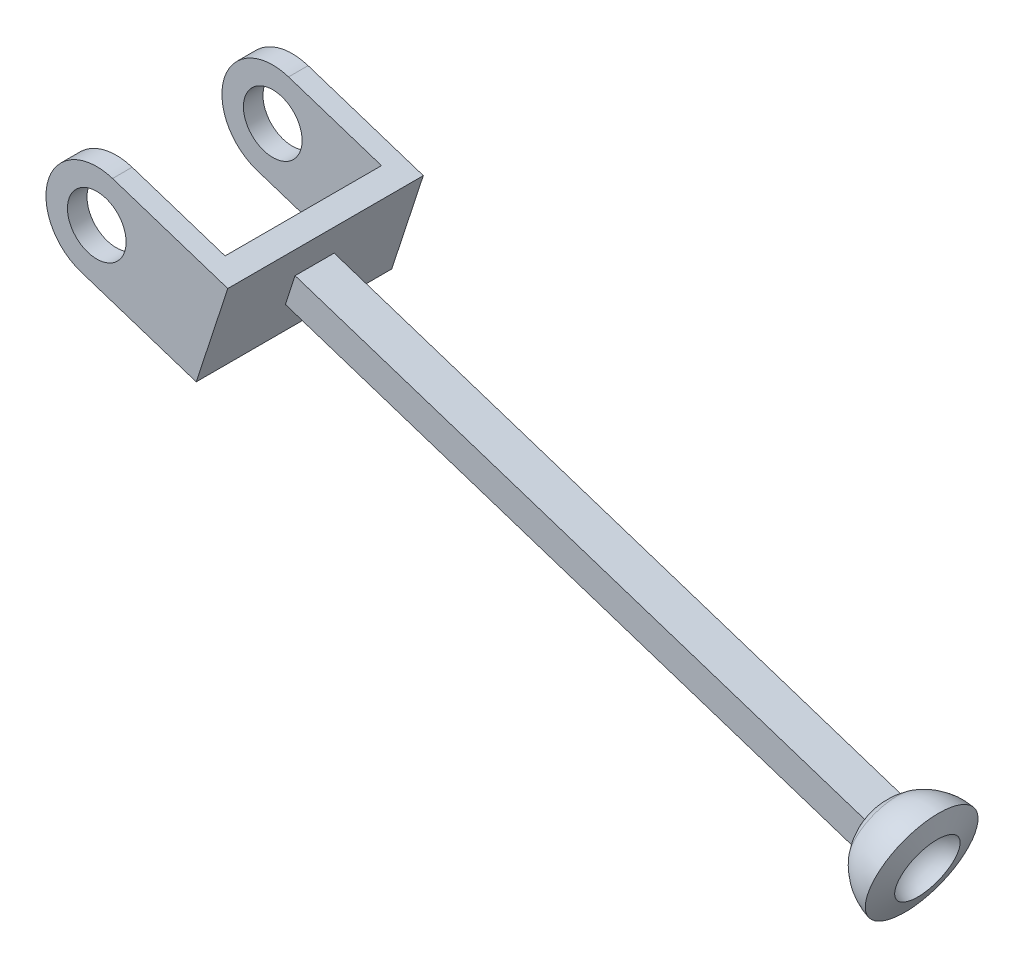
ISO-10303-21;
HEADER;
FILE_DESCRIPTION(('STEP AP214'),'2;1');
FILE_NAME('part.step','',(''),(''),'','','');
FILE_SCHEMA(('AUTOMOTIVE_DESIGN { 1 0 10303 214 1 1 1 1 }'));
ENDSEC;
DATA;
#1=APPLICATION_CONTEXT('core data for automotive mechanical design processes');
#2=APPLICATION_PROTOCOL_DEFINITION('international standard','automotive_design',2000,#1);
#3=PRODUCT_CONTEXT('',#1,'mechanical');
#4=PRODUCT('Part','Part','',(#3));
#5=PRODUCT_RELATED_PRODUCT_CATEGORY('part','',(#4));
#6=PRODUCT_DEFINITION_FORMATION('','',#4);
#7=PRODUCT_DEFINITION_CONTEXT('part definition',#1,'design');
#8=PRODUCT_DEFINITION('design','',#6,#7);
#9=PRODUCT_DEFINITION_SHAPE('','',#8);
#10=(LENGTH_UNIT() NAMED_UNIT(*) SI_UNIT(.MILLI.,.METRE.));
#11=(NAMED_UNIT(*) PLANE_ANGLE_UNIT() SI_UNIT($,.RADIAN.));
#12=(NAMED_UNIT(*) SI_UNIT($,.STERADIAN.) SOLID_ANGLE_UNIT());
#13=UNCERTAINTY_MEASURE_WITH_UNIT(LENGTH_MEASURE(1.E-05),#10,'distance_accuracy_value','');
#14=(GEOMETRIC_REPRESENTATION_CONTEXT(3) GLOBAL_UNCERTAINTY_ASSIGNED_CONTEXT((#13)) GLOBAL_UNIT_ASSIGNED_CONTEXT((#10,
#11,#12)) REPRESENTATION_CONTEXT('',''));
#15=CARTESIAN_POINT('',(0.,0.,0.));
#16=DIRECTION('',(0.,0.,1.));
#17=DIRECTION('',(1.,0.,0.));
#18=AXIS2_PLACEMENT_3D('',#15,#16,#17);
#19=CARTESIAN_POINT('',(13195.3800261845,5759.56814998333,-22.8728127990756));
#20=DIRECTION('',(0.950575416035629,-0.310493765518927,1.60278153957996E-06));
#21=DIRECTION('',(0.310493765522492,0.950575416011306,-6.8262459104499E-06));
#22=AXIS2_PLACEMENT_3D('',#19,#20,#21);
#23=SPHERICAL_SURFACE('',#22,9.14400000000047);
#24=CARTESIAN_POINT('',(13188.6677202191,5761.76064215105,-22.87282411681));
#25=DIRECTION('',(0.950575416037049,-0.31049376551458,1.60278153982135E-06));
#26=DIRECTION('',(0.310493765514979,0.95057541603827,0.));
#27=AXIS2_PLACEMENT_3D('',#24,#25,#26);
#28=CIRCLE('',#27,5.80953205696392);
#29=CARTESIAN_POINT('',(13190.4715437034,5767.28304050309,-22.87282411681));
#30=VERTEX_POINT('',#29);
#31=EDGE_CURVE('E170',#30,#30,#28,.T.);
#32=ORIENTED_EDGE('',*,*,#31,.F.);
#33=EDGE_LOOP('',(#32));
#34=FACE_BOUND('',#33,.T.);
#35=CARTESIAN_POINT('',(13195.3800280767,5759.56817216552,-19.6978127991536));
#36=DIRECTION('',(-5.95942068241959E-07,-6.98651522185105E-06,-0.999999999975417));
#37=DIRECTION('',(0.,0.999999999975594,-6.9865152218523E-06));
#38=AXIS2_PLACEMENT_3D('',#35,#36,#37);
#39=CIRCLE('',#38,8.57508664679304);
#40=CARTESIAN_POINT('',(13186.8059052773,5759.69673818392,-19.6978085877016));
#41=VERTEX_POINT('',#40);
#42=CARTESIAN_POINT('',(13188.3832136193,5764.52566129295,-19.6978432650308));
#43=VERTEX_POINT('',#42);
#44=EDGE_CURVE('E42',#41,#43,#39,.T.);
#45=ORIENTED_EDGE('',*,*,#44,.F.);
#46=CARTESIAN_POINT('',(13194.5913720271,5757.15368844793,-22.8727954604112));
#47=DIRECTION('',(-0.310493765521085,-0.950575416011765,6.82624591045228E-06));
#48=DIRECTION('',(0.950575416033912,-0.310493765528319,0.));
#49=AXIS2_PLACEMENT_3D('',#46,#47,#48);
#50=CIRCLE('',#49,8.78414117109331);
#51=CARTESIAN_POINT('',(13186.805901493,5759.69669381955,-26.0478085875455));
#52=VERTEX_POINT('',#51);
#53=EDGE_CURVE('E182',#41,#52,#50,.T.);
#54=ORIENTED_EDGE('',*,*,#53,.T.);
#55=CARTESIAN_POINT('',(13195.3800242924,5759.56812780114,-26.0478127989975));
#56=DIRECTION('',(5.9594206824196E-07,6.98651522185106E-06,0.999999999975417));
#57=DIRECTION('',(0.,-0.999999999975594,6.9865152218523E-06));
#58=AXIS2_PLACEMENT_3D('',#55,#56,#57);
#59=CIRCLE('',#58,8.57508664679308);
#60=CARTESIAN_POINT('',(13188.3832098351,5764.52561692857,-26.0478432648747));
#61=VERTEX_POINT('',#60);
#62=EDGE_CURVE('E179',#61,#52,#59,.T.);
#63=ORIENTED_EDGE('',*,*,#62,.F.);
#64=CARTESIAN_POINT('',(13196.1686803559,5761.98261156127,-22.8728301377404));
#65=DIRECTION('',(0.310493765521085,0.950575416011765,-6.82624591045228E-06));
#66=DIRECTION('',(-0.950575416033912,0.310493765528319,0.));
#67=AXIS2_PLACEMENT_3D('',#64,#65,#66);
#68=CIRCLE('',#67,8.78414115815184);
#69=EDGE_CURVE('E176',#61,#43,#68,.T.);
#70=ORIENTED_EDGE('',*,*,#69,.T.);
#71=EDGE_LOOP('',(#45,#54,#63,#70));
#72=FACE_BOUND('',#71,.T.);
#73=ADVANCED_FACE('F32',(#34,#72),#23,.T.);
#74=CARTESIAN_POINT('',(13085.847290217,5792.67360498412,-22.8729788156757));
#75=DIRECTION('',(-0.310493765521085,-0.950575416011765,6.82624591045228E-06));
#76=DIRECTION('',(0.950575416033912,-0.310493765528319,0.));
#77=AXIS2_PLACEMENT_3D('',#74,#75,#76);
#78=PLANE('',#77);
#79=DIRECTION('',(5.95942089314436E-07,6.98651521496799E-06,0.999999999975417));
#80=VECTOR('',#79,1.);
#81=CARTESIAN_POINT('',(13094.2979056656,5789.91331540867,-22.872964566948));
#82=LINE('',#81,#80);
#83=CARTESIAN_POINT('',(13094.2979037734,5789.91329322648,-26.0479645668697));
#84=VERTEX_POINT('',#83);
#85=CARTESIAN_POINT('',(13094.2979075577,5789.91333759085,-19.6979645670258));
#86=VERTEX_POINT('',#85);
#87=EDGE_CURVE('E57',#84,#86,#82,.T.);
#88=ORIENTED_EDGE('',*,*,#87,.F.);
#89=DIRECTION('',(0.950575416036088,-0.310493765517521,1.6027815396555E-06));
#90=VECTOR('',#89,1.);
#91=CARTESIAN_POINT('',(13091.8834422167,5790.7019473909,-26.0479686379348));
#92=LINE('',#91,#90);
#93=EDGE_CURVE('E36',#84,#52,#92,.T.);
#94=ORIENTED_EDGE('',*,*,#93,.T.);
#95=ORIENTED_EDGE('',*,*,#53,.F.);
#96=DIRECTION('',(-0.950575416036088,0.310493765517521,-1.60278153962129E-06));
#97=VECTOR('',#96,1.);
#98=CARTESIAN_POINT('',(13188.2865577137,5759.21310128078,-19.6978060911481));
#99=LINE('',#98,#97);
#100=EDGE_CURVE('E214',#41,#86,#99,.T.);
#101=ORIENTED_EDGE('',*,*,#100,.T.);
#102=EDGE_LOOP('',(#88,#94,#95,#101));
#103=FACE_BOUND('',#102,.T.);
#104=ADVANCED_FACE('F263',(#103),#78,.T.);
#105=CARTESIAN_POINT('',(13087.4245966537,5797.50250591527,-26.0480134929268));
#106=DIRECTION('',(5.9594206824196E-07,6.98651522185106E-06,0.999999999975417));
#107=DIRECTION('',(0.,-0.999999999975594,6.9865152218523E-06));
#108=AXIS2_PLACEMENT_3D('',#105,#106,#107);
#109=PLANE('',#108);
#110=ORIENTED_EDGE('',*,*,#93,.F.);
#111=DIRECTION('',(0.310493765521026,0.950575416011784,-6.82624591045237E-06));
#112=VECTOR('',#111,1.);
#113=CARTESIAN_POINT('',(13095.8752121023,5794.74221633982,-26.047999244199));
#114=LINE('',#113,#112);
#115=CARTESIAN_POINT('',(13095.8752121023,5794.74221633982,-26.047999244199));
#116=VERTEX_POINT('',#115);
#117=EDGE_CURVE('E165',#84,#116,#114,.T.);
#118=ORIENTED_EDGE('',*,*,#117,.T.);
#119=DIRECTION('',(-0.950575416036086,0.310493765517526,-1.60278153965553E-06));
#120=VECTOR('',#119,1.);
#121=CARTESIAN_POINT('',(13189.8638622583,5764.04198002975,-26.0478407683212));
#122=LINE('',#121,#120);
#123=EDGE_CURVE('E206',#61,#116,#122,.T.);
#124=ORIENTED_EDGE('',*,*,#123,.F.);
#125=ORIENTED_EDGE('',*,*,#62,.T.);
#126=EDGE_LOOP('',(#110,#118,#124,#125));
#127=FACE_BOUND('',#126,.T.);
#128=ADVANCED_FACE('F266',(#127),#109,.F.);
#129=CARTESIAN_POINT('',(13190.5431421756,5763.82012440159,-22.8728396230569));
#130=DIRECTION('',(0.310493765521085,0.950575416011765,-6.82624591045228E-06));
#131=DIRECTION('',(-0.950575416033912,0.310493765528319,0.));
#132=AXIS2_PLACEMENT_3D('',#129,#130,#131);
#133=PLANE('',#132);
#134=DIRECTION('',(-5.95942089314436E-07,-6.98651521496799E-06,-0.999999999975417));
#135=VECTOR('',#134,1.);
#136=CARTESIAN_POINT('',(13095.8752139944,5794.74223852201,-22.8729992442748));
#137=LINE('',#136,#135);
#138=CARTESIAN_POINT('',(13095.8752158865,5794.74226070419,-19.6979992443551));
#139=VERTEX_POINT('',#138);
#140=EDGE_CURVE('E163',#139,#116,#137,.T.);
#141=ORIENTED_EDGE('',*,*,#140,.F.);
#142=DIRECTION('',(0.95057541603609,-0.310493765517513,1.60278153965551E-06));
#143=VECTOR('',#142,1.);
#144=CARTESIAN_POINT('',(13093.4607543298,5795.53091486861,-19.6980033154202));
#145=LINE('',#144,#143);
#146=EDGE_CURVE('E210',#139,#43,#145,.T.);
#147=ORIENTED_EDGE('',*,*,#146,.T.);
#148=ORIENTED_EDGE('',*,*,#69,.F.);
#149=ORIENTED_EDGE('',*,*,#123,.T.);
#150=EDGE_LOOP('',(#141,#147,#148,#149));
#151=FACE_BOUND('',#150,.T.);
#152=ADVANCED_FACE('F270',(#151),#133,.T.);
#153=CARTESIAN_POINT('',(13190.5431440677,5763.82014658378,-19.697839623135));
#154=DIRECTION('',(-5.95942068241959E-07,-6.98651522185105E-06,-0.999999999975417));
#155=DIRECTION('',(0.,0.999999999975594,-6.9865152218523E-06));
#156=AXIS2_PLACEMENT_3D('',#153,#154,#155);
#157=PLANE('',#156);
#158=ORIENTED_EDGE('',*,*,#146,.F.);
#159=DIRECTION('',(-0.310493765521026,-0.950575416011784,6.82624591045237E-06));
#160=VECTOR('',#159,1.);
#161=CARTESIAN_POINT('',(13095.8752158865,5794.74226070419,-19.6979992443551));
#162=LINE('',#161,#160);
#163=EDGE_CURVE('E11',#139,#86,#162,.T.);
#164=ORIENTED_EDGE('',*,*,#163,.T.);
#165=ORIENTED_EDGE('',*,*,#100,.F.);
#166=ORIENTED_EDGE('',*,*,#44,.T.);
#167=EDGE_LOOP('',(#158,#164,#165,#166));
#168=FACE_BOUND('',#167,.T.);
#169=ADVANCED_FACE('F34',(#168),#157,.F.);
#170=CARTESIAN_POINT('',(13194.9564544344,5759.70650448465,-22.8728135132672));
#171=DIRECTION('',(0.950575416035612,-0.310493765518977,1.60278153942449E-06));
#172=DIRECTION('',(0.310493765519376,0.950575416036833,0.));
#173=AXIS2_PLACEMENT_3D('',#170,#171,#172);
#174=DEGENERATE_TOROIDAL_SURFACE('',#173,0.128854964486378,8.88999999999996,.F.);
#175=ORIENTED_EDGE('',*,*,#31,.T.);
#176=EDGE_LOOP('',(#175));
#177=FACE_BOUND('',#176,.T.);
#178=CARTESIAN_POINT('',(13194.4465426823,5759.87306088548,-22.8728143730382));
#179=DIRECTION('',(0.950575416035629,-0.310493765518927,1.60278153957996E-06));
#180=DIRECTION('',(0.310493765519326,0.95057541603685,0.));
#181=AXIS2_PLACEMENT_3D('',#178,#179,#180);
#182=CIRCLE('',#181,8.74494630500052);
#183=CARTESIAN_POINT('',(13197.1617939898,5768.18579185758,-22.8728143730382));
#184=VERTEX_POINT('',#183);
#185=EDGE_CURVE('E169',#184,#184,#182,.F.);
#186=ORIENTED_EDGE('',*,*,#185,.T.);
#187=EDGE_LOOP('',(#186));
#188=FACE_BOUND('',#187,.T.);
#189=ADVANCED_FACE('F315',(#177,#188),#174,.F.);
#190=CARTESIAN_POINT('',(13195.3800261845,5759.56814998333,-22.8728127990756));
#191=DIRECTION('',(0.950575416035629,-0.310493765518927,1.60278153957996E-06));
#192=DIRECTION('',(0.310493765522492,0.950575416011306,-6.8262459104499E-06));
#193=AXIS2_PLACEMENT_3D('',#190,#191,#192);
#194=SPHERICAL_SURFACE('',#193,5.07999999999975);
#195=CARTESIAN_POINT('',(13195.3800261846,5759.56814998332,-22.8728127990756));
#196=DIRECTION('',(0.950575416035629,-0.310493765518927,1.60278153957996E-06));
#197=DIRECTION('',(0.310493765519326,0.95057541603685,0.));
#198=AXIS2_PLACEMENT_3D('',#195,#196,#197);
#199=CIRCLE('',#198,5.08000000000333);
#200=CARTESIAN_POINT('',(13196.9573345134,5764.39707309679,-22.8728127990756));
#201=VERTEX_POINT('',#200);
#202=EDGE_CURVE('E173',#201,#201,#199,.T.);
#203=ORIENTED_EDGE('',*,*,#202,.T.);
#204=EDGE_LOOP('',(#203));
#205=FACE_BOUND('',#204,.T.);
#206=ADVANCED_FACE('F324',(#205),#194,.F.);
#207=CARTESIAN_POINT('',(13195.3800261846,5759.56814998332,-22.8728127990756));
#208=DIRECTION('',(-0.950575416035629,0.310493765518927,-1.60278153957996E-06));
#209=DIRECTION('',(-0.310493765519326,-0.95057541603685,0.));
#210=AXIS2_PLACEMENT_3D('',#207,#208,#209);
#211=CONICAL_SURFACE('',#210,5.08000000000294,1.30899693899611);
#212=ORIENTED_EDGE('',*,*,#185,.F.);
#213=EDGE_LOOP('',(#212));
#214=FACE_BOUND('',#213,.T.);
#215=ORIENTED_EDGE('',*,*,#202,.F.);
#216=EDGE_LOOP('',(#215));
#217=FACE_BOUND('',#216,.T.);
#218=ADVANCED_FACE('F275',(#214,#217),#211,.T.);
#219=CARTESIAN_POINT('',(13097.6496764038,5800.1746661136,-38.7480382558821));
#220=DIRECTION('',(0.950575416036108,-0.310493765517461,1.60278151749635E-06));
#221=DIRECTION('',(0.31049376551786,0.950575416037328,0.));
#222=AXIS2_PLACEMENT_3D('',#219,#220,#221);
#223=PLANE('',#222);
#224=ORIENTED_EDGE('',*,*,#117,.F.);
#225=ORIENTED_EDGE('',*,*,#87,.T.);
#226=ORIENTED_EDGE('',*,*,#163,.F.);
#227=ORIENTED_EDGE('',*,*,#140,.T.);
#228=EDGE_LOOP('',(#224,#225,#226,#227));
#229=FACE_BOUND('',#228,.T.);
#230=DIRECTION('',(0.310493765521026,0.950575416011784,-6.82624591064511E-06));
#231=VECTOR('',#230,1.);
#232=CARTESIAN_POINT('',(13092.523424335,5784.48066599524,-38.7479255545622));
#233=LINE('',#232,#231);
#234=CARTESIAN_POINT('',(13092.523424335,5784.48066599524,-38.7479255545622));
#235=VERTEX_POINT('',#234);
#236=CARTESIAN_POINT('',(13097.6496764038,5800.1746661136,-38.7480382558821));
#237=VERTEX_POINT('',#236);
#238=EDGE_CURVE('E151',#235,#237,#233,.T.);
#239=ORIENTED_EDGE('',*,*,#238,.T.);
#240=DIRECTION('',(5.95942095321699E-07,6.9865152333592E-06,0.999999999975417));
#241=VECTOR('',#240,1.);
#242=CARTESIAN_POINT('',(13097.6496764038,5800.1746661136,-38.7480382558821));
#243=LINE('',#242,#241);
#244=CARTESIAN_POINT('',(13097.6496953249,5800.17488793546,-6.99803825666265));
#245=VERTEX_POINT('',#244);
#246=EDGE_CURVE('E154',#237,#245,#243,.T.);
#247=ORIENTED_EDGE('',*,*,#246,.T.);
#248=DIRECTION('',(-0.310493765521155,-0.950575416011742,6.82624591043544E-06));
#249=VECTOR('',#248,1.);
#250=CARTESIAN_POINT('',(13097.6496953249,5800.17488793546,-6.99803825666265));
#251=LINE('',#250,#249);
#252=CARTESIAN_POINT('',(13092.5234432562,5784.4808878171,-6.99792555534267));
#253=VERTEX_POINT('',#252);
#254=EDGE_CURVE('E157',#245,#253,#251,.T.);
#255=ORIENTED_EDGE('',*,*,#254,.T.);
#256=DIRECTION('',(-5.95942039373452E-07,-6.98651528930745E-06,-0.999999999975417));
#257=VECTOR('',#256,1.);
#258=CARTESIAN_POINT('',(13092.5234432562,5784.4808878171,-6.99792555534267));
#259=LINE('',#258,#257);
#260=EDGE_CURVE('E160',#253,#235,#259,.T.);
#261=ORIENTED_EDGE('',*,*,#260,.T.);
#262=EDGE_LOOP('',(#239,#247,#255,#261));
#263=FACE_BOUND('',#262,.T.);
#264=ADVANCED_FACE('F271',(#229,#263),#223,.T.);
#265=CARTESIAN_POINT('',(13076.3744751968,5798.43975801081,-35.5730134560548));
#266=DIRECTION('',(-5.95942263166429E-07,-6.98651523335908E-06,-0.999999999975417));
#267=DIRECTION('',(0.,0.999999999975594,-6.98651523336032E-06));
#268=AXIS2_PLACEMENT_3D('',#265,#266,#267);
#269=CYLINDRICAL_SURFACE('',#268,4.7625000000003);
#270=CARTESIAN_POINT('',(13076.3744751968,5798.43975801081,-35.5730134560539));
#271=DIRECTION('',(-5.95942263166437E-07,-6.98651523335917E-06,-0.999999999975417));
#272=DIRECTION('',(0.,0.999999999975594,-6.98651523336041E-06));
#273=AXIS2_PLACEMENT_3D('',#270,#271,#272);
#274=CIRCLE('',#273,4.7625000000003);
#275=CARTESIAN_POINT('',(13076.3744751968,5803.2022580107,-35.5730467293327));
#276=VERTEX_POINT('',#275);
#277=EDGE_CURVE('E185',#276,#276,#274,.T.);
#278=ORIENTED_EDGE('',*,*,#277,.F.);
#279=EDGE_LOOP('',(#278));
#280=FACE_BOUND('',#279,.T.);
#281=CARTESIAN_POINT('',(13076.3744733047,5798.43973582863,-38.7480134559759));
#282=DIRECTION('',(-5.95942263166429E-07,-6.98651523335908E-06,-0.999999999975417));
#283=DIRECTION('',(0.,0.999999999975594,-6.98651523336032E-06));
#284=AXIS2_PLACEMENT_3D('',#281,#282,#283);
#285=CIRCLE('',#284,4.7625000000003);
#286=CARTESIAN_POINT('',(13076.3744733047,5803.20223582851,-38.7480467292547));
#287=VERTEX_POINT('',#286);
#288=EDGE_CURVE('E190',#287,#287,#285,.F.);
#289=ORIENTED_EDGE('',*,*,#288,.F.);
#290=EDGE_LOOP('',(#289));
#291=FACE_BOUND('',#290,.T.);
#292=ADVANCED_FACE('F274',(#280,#291),#269,.F.);
#293=CARTESIAN_POINT('',(13076.3744922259,5798.43995765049,-6.99801345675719));
#294=DIRECTION('',(-5.95942263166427E-07,-6.98651523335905E-06,-0.999999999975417));
#295=DIRECTION('',(0.,0.999999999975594,-6.98651523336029E-06));
#296=AXIS2_PLACEMENT_3D('',#293,#294,#295);
#297=CYLINDRICAL_SURFACE('',#296,4.7625000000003);
#298=CARTESIAN_POINT('',(13076.3744922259,5798.43995765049,-6.99801345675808));
#299=DIRECTION('',(-5.95942263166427E-07,-6.98651523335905E-06,-0.999999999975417));
#300=DIRECTION('',(0.,0.999999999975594,-6.98651523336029E-06));
#301=AXIS2_PLACEMENT_3D('',#298,#299,#300);
#302=CIRCLE('',#301,4.7625000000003);
#303=CARTESIAN_POINT('',(13076.3744922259,5803.20245765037,-6.99804673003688));
#304=VERTEX_POINT('',#303);
#305=EDGE_CURVE('E228',#304,#304,#302,.T.);
#306=ORIENTED_EDGE('',*,*,#305,.F.);
#307=EDGE_LOOP('',(#306));
#308=FACE_BOUND('',#307,.T.);
#309=CARTESIAN_POINT('',(13076.3744903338,5798.4399354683,-10.1730134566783));
#310=DIRECTION('',(-5.95942263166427E-07,-6.98651523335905E-06,-0.999999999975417));
#311=DIRECTION('',(0.,0.999999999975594,-6.98651523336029E-06));
#312=AXIS2_PLACEMENT_3D('',#309,#310,#311);
#313=CIRCLE('',#312,4.7625000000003);
#314=CARTESIAN_POINT('',(13076.3744903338,5803.20243546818,-10.1730467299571));
#315=VERTEX_POINT('',#314);
#316=EDGE_CURVE('E248',#315,#315,#313,.F.);
#317=ORIENTED_EDGE('',*,*,#316,.F.);
#318=EDGE_LOOP('',(#317));
#319=FACE_BOUND('',#318,.T.);
#320=ADVANCED_FACE('F304',(#308,#319),#297,.F.);
#321=CARTESIAN_POINT('',(13076.3744922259,5798.43995765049,-6.99801345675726));
#322=DIRECTION('',(-5.95942263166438E-07,-6.98651523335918E-06,-0.999999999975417));
#323=DIRECTION('',(0.,0.999999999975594,-6.98651523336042E-06));
#324=AXIS2_PLACEMENT_3D('',#321,#322,#323);
#325=CYLINDRICAL_SURFACE('',#324,8.2550000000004);
#326=DIRECTION('',(2.11950679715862E-06,6.48886154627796E-06,0.999999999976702));
#327=VECTOR('',#326,1.);
#328=CARTESIAN_POINT('',(13078.9376182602,5806.28695770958,-6.99808303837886));
#329=LINE('',#328,#327);
#330=CARTESIAN_POINT('',(13078.9376182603,5806.28695770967,-6.99806980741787));
#331=VERTEX_POINT('',#330);
#332=CARTESIAN_POINT('',(13078.9376139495,5806.28693631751,-10.1730698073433));
#333=VERTEX_POINT('',#332);
#334=EDGE_CURVE('E217',#331,#333,#329,.F.);
#335=ORIENTED_EDGE('',*,*,#334,.T.);
#336=CARTESIAN_POINT('',(13076.3744903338,5798.4399354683,-10.1730134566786));
#337=DIRECTION('',(-5.95942263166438E-07,-6.98651523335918E-06,-0.999999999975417));
#338=DIRECTION('',(0.,0.999999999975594,-6.98651523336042E-06));
#339=AXIS2_PLACEMENT_3D('',#336,#337,#338);
#340=CIRCLE('',#339,8.2550000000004);
#341=CARTESIAN_POINT('',(13073.8113642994,5790.59293540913,-10.1729571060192));
#342=VERTEX_POINT('',#341);
#343=EDGE_CURVE('E232',#333,#342,#340,.F.);
#344=ORIENTED_EDGE('',*,*,#343,.T.);
#345=DIRECTION('',(2.11950679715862E-06,6.48886154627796E-06,0.999999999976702));
#346=VECTOR('',#345,1.);
#347=CARTESIAN_POINT('',(13073.8113710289,5790.59295601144,-6.99792962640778));
#348=LINE('',#347,#346);
#349=CARTESIAN_POINT('',(13073.8113686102,5790.59295680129,-6.9979571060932));
#350=VERTEX_POINT('',#349);
#351=EDGE_CURVE('E221',#342,#350,#348,.T.);
#352=ORIENTED_EDGE('',*,*,#351,.T.);
#353=CARTESIAN_POINT('',(13076.3744922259,5798.43995765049,-6.9980134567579));
#354=DIRECTION('',(-5.95942263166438E-07,-6.98651523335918E-06,-0.999999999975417));
#355=DIRECTION('',(0.,0.999999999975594,-6.98651523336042E-06));
#356=AXIS2_PLACEMENT_3D('',#353,#354,#355);
#357=CIRCLE('',#356,8.2550000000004);
#358=EDGE_CURVE('E196',#331,#350,#357,.F.);
#359=ORIENTED_EDGE('',*,*,#358,.F.);
#360=EDGE_LOOP('',(#335,#344,#352,#359));
#361=FACE_BOUND('',#360,.T.);
#362=ADVANCED_FACE('F296',(#361),#325,.T.);
#363=CARTESIAN_POINT('',(13076.3744751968,5798.43975801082,-35.5730134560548));
#364=DIRECTION('',(-5.95942263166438E-07,-6.98651523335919E-06,-0.999999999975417));
#365=DIRECTION('',(0.,0.999999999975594,-6.98651523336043E-06));
#366=AXIS2_PLACEMENT_3D('',#363,#364,#365);
#367=CYLINDRICAL_SURFACE('',#366,8.2550000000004);
#368=DIRECTION('',(2.11950679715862E-06,6.48886154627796E-06,0.999999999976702));
#369=VECTOR('',#368,1.);
#370=CARTESIAN_POINT('',(13078.9376617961,5806.28694348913,-6.99808303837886));
#371=LINE('',#370,#369);
#372=CARTESIAN_POINT('',(13078.9376012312,5806.28675806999,-35.5730698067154));
#373=VERTEX_POINT('',#372);
#374=CARTESIAN_POINT('',(13078.9375969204,5806.28673667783,-38.7480698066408));
#375=VERTEX_POINT('',#374);
#376=EDGE_CURVE('E130',#373,#375,#371,.F.);
#377=ORIENTED_EDGE('',*,*,#376,.T.);
#378=CARTESIAN_POINT('',(13076.3744733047,5798.43973582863,-38.7480134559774));
#379=DIRECTION('',(-5.95942263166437E-07,-6.98651523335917E-06,-0.999999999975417));
#380=DIRECTION('',(0.,0.999999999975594,-6.98651523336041E-06));
#381=AXIS2_PLACEMENT_3D('',#378,#379,#380);
#382=CIRCLE('',#381,8.2550000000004);
#383=CARTESIAN_POINT('',(13073.8113472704,5790.59273576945,-38.7479571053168));
#384=VERTEX_POINT('',#383);
#385=EDGE_CURVE('E189',#384,#375,#382,.T.);
#386=ORIENTED_EDGE('',*,*,#385,.F.);
#387=DIRECTION('',(2.11950679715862E-06,6.48886154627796E-06,0.999999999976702));
#388=VECTOR('',#387,1.);
#389=CARTESIAN_POINT('',(13073.8114145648,5790.59294179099,-6.99792962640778));
#390=LINE('',#389,#388);
#391=CARTESIAN_POINT('',(13073.8113515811,5790.59275716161,-35.5729571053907));
#392=VERTEX_POINT('',#391);
#393=EDGE_CURVE('E229',#384,#392,#390,.T.);
#394=ORIENTED_EDGE('',*,*,#393,.T.);
#395=CARTESIAN_POINT('',(13076.3744751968,5798.43975801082,-35.5730134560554));
#396=DIRECTION('',(-5.95942263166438E-07,-6.98651523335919E-06,-0.999999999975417));
#397=DIRECTION('',(0.,0.999999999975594,-6.98651523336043E-06));
#398=AXIS2_PLACEMENT_3D('',#395,#396,#397);
#399=CIRCLE('',#398,8.2550000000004);
#400=EDGE_CURVE('E251',#392,#373,#399,.T.);
#401=ORIENTED_EDGE('',*,*,#400,.T.);
#402=EDGE_LOOP('',(#377,#386,#394,#401));
#403=FACE_BOUND('',#402,.T.);
#404=ADVANCED_FACE('F294',(#403),#367,.T.);
#405=CARTESIAN_POINT('',(13068.5274751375,5801.00288404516,-35.5730266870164));
#406=DIRECTION('',(5.95942068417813E-07,6.98651522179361E-06,0.999999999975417));
#407=DIRECTION('',(0.,-0.999999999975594,6.98651522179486E-06));
#408=AXIS2_PLACEMENT_3D('',#405,#406,#407);
#409=PLANE('',#408);
#410=DIRECTION('',(-0.950575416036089,0.310493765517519,-1.60278153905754E-06));
#411=VECTOR('',#410,1.);
#412=CARTESIAN_POINT('',(13089.1990628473,5802.93497787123,-35.5730525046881));
#413=LINE('',#412,#411);
#414=CARTESIAN_POINT('',(13094.0279859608,5801.3576695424,-35.5730443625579));
#415=VERTEX_POINT('',#414);
#416=EDGE_CURVE('E123',#415,#373,#413,.T.);
#417=ORIENTED_EDGE('',*,*,#416,.T.);
#418=ORIENTED_EDGE('',*,*,#400,.F.);
#419=DIRECTION('',(0.950575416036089,-0.310493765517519,1.60278153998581E-06));
#420=VECTOR('',#419,1.);
#421=CARTESIAN_POINT('',(13073.8113539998,5790.59275637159,-35.5729571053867));
#422=LINE('',#421,#420);
#423=CARTESIAN_POINT('',(13088.901733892,5785.66366942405,-35.5729316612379));
#424=VERTEX_POINT('',#423);
#425=EDGE_CURVE('E139',#392,#424,#422,.T.);
#426=ORIENTED_EDGE('',*,*,#425,.T.);
#427=DIRECTION('',(-0.310493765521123,-0.950575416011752,6.82624591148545E-06));
#428=VECTOR('',#427,1.);
#429=CARTESIAN_POINT('',(13094.0279859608,5801.3576695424,-35.5730443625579));
#430=LINE('',#429,#428);
#431=EDGE_CURVE('E135',#415,#424,#430,.T.);
#432=ORIENTED_EDGE('',*,*,#431,.F.);
#433=EDGE_LOOP('',(#417,#418,#426,#432));
#434=FACE_BOUND('',#433,.T.);
#435=ORIENTED_EDGE('',*,*,#277,.T.);
#436=EDGE_LOOP('',(#435));
#437=FACE_BOUND('',#436,.T.);
#438=ADVANCED_FACE('F136',(#434,#437),#409,.T.);
#439=CARTESIAN_POINT('',(13086.6359519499,5795.08815526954,-10.1729961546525));
#440=DIRECTION('',(-5.95942068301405E-07,-6.98651522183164E-06,-0.999999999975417));
#441=DIRECTION('',(0.,0.999999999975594,-6.98651522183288E-06));
#442=AXIS2_PLACEMENT_3D('',#439,#440,#441);
#443=PLANE('',#442);
#444=DIRECTION('',(-0.950575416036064,0.310493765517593,-1.60278153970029E-06));
#445=VECTOR('',#444,1.);
#446=CARTESIAN_POINT('',(13084.0728259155,5787.24115521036,-10.1729398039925));
#447=LINE('',#446,#445);
#448=CARTESIAN_POINT('',(13088.901749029,5785.66384688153,-10.1729316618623));
#449=VERTEX_POINT('',#448);
#450=EDGE_CURVE('E223',#449,#342,#447,.T.);
#451=ORIENTED_EDGE('',*,*,#450,.T.);
#452=ORIENTED_EDGE('',*,*,#343,.F.);
#453=DIRECTION('',(0.950575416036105,-0.31049376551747,1.60278153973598E-06));
#454=VECTOR('',#453,1.);
#455=CARTESIAN_POINT('',(13078.9376115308,5806.28693710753,-10.1730698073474));
#456=LINE('',#455,#454);
#457=CARTESIAN_POINT('',(13094.0280010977,5801.35784699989,-10.1730443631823));
#458=VERTEX_POINT('',#457);
#459=EDGE_CURVE('E49',#333,#458,#456,.T.);
#460=ORIENTED_EDGE('',*,*,#459,.T.);
#461=DIRECTION('',(0.310493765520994,0.950575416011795,-6.82624591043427E-06));
#462=VECTOR('',#461,1.);
#463=CARTESIAN_POINT('',(13088.901749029,5785.66384688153,-10.1729316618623));
#464=LINE('',#463,#462);
#465=EDGE_CURVE('E146',#449,#458,#464,.T.);
#466=ORIENTED_EDGE('',*,*,#465,.F.);
#467=EDGE_LOOP('',(#451,#452,#460,#466));
#468=FACE_BOUND('',#467,.T.);
#469=ORIENTED_EDGE('',*,*,#316,.T.);
#470=EDGE_LOOP('',(#469));
#471=FACE_BOUND('',#470,.T.);
#472=ADVANCED_FACE('F302',(#468,#471),#443,.T.);
#473=CARTESIAN_POINT('',(13090.1089816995,5785.26954198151,-6.99792962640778));
#474=DIRECTION('',(0.310493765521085,0.950575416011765,-6.82624591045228E-06));
#475=DIRECTION('',(-0.950575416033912,0.310493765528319,0.));
#476=AXIS2_PLACEMENT_3D('',#473,#474,#475);
#477=PLANE('',#476);
#478=ORIENTED_EDGE('',*,*,#450,.F.);
#479=DIRECTION('',(5.95942053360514E-07,6.9865151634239E-06,0.999999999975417));
#480=VECTOR('',#479,1.);
#481=CARTESIAN_POINT('',(13088.901733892,5785.66366942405,-35.5729316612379));
#482=LINE('',#481,#480);
#483=EDGE_CURVE('E143',#424,#449,#482,.T.);
#484=ORIENTED_EDGE('',*,*,#483,.F.);
#485=ORIENTED_EDGE('',*,*,#425,.F.);
#486=ORIENTED_EDGE('',*,*,#393,.F.);
#487=DIRECTION('',(-0.950575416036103,0.310493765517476,-1.60278153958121E-06));
#488=VECTOR('',#487,1.);
#489=CARTESIAN_POINT('',(13090.1089627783,5785.26932015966,-38.7479296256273));
#490=LINE('',#489,#488);
#491=EDGE_CURVE('E186',#235,#384,#490,.T.);
#492=ORIENTED_EDGE('',*,*,#491,.F.);
#493=ORIENTED_EDGE('',*,*,#260,.F.);
#494=DIRECTION('',(0.950575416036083,-0.310493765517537,1.60278153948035E-06));
#495=VECTOR('',#494,1.);
#496=CARTESIAN_POINT('',(13073.8113661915,5790.59295759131,-6.99795710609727));
#497=LINE('',#496,#495);
#498=EDGE_CURVE('E197',#350,#253,#497,.T.);
#499=ORIENTED_EDGE('',*,*,#498,.F.);
#500=ORIENTED_EDGE('',*,*,#351,.F.);
#501=EDGE_LOOP('',(#478,#484,#485,#486,#492,#493,#499,#500));
#502=FACE_BOUND('',#501,.T.);
#503=ADVANCED_FACE('F291',(#502),#477,.F.);
#504=CARTESIAN_POINT('',(13044.3828765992,5808.88962532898,-6.99806739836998));
#505=DIRECTION('',(5.95942068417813E-07,6.98651522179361E-06,0.999999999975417));
#506=DIRECTION('',(0.,-0.999999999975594,6.98651522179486E-06));
#507=AXIS2_PLACEMENT_3D('',#504,#505,#506);
#508=PLANE('',#507);
#509=DIRECTION('',(-0.950575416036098,0.31049376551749,-1.60278153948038E-06));
#510=VECTOR('',#509,1.);
#511=CARTESIAN_POINT('',(13095.2352337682,5800.96354209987,-6.99804232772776));
#512=LINE('',#511,#510);
#513=EDGE_CURVE('E193',#245,#331,#512,.T.);
#514=ORIENTED_EDGE('',*,*,#513,.T.);
#515=ORIENTED_EDGE('',*,*,#358,.T.);
#516=ORIENTED_EDGE('',*,*,#498,.T.);
#517=ORIENTED_EDGE('',*,*,#254,.F.);
#518=EDGE_LOOP('',(#514,#515,#516,#517));
#519=FACE_BOUND('',#518,.T.);
#520=ORIENTED_EDGE('',*,*,#305,.T.);
#521=EDGE_LOOP('',(#520));
#522=FACE_BOUND('',#521,.T.);
#523=ADVANCED_FACE('F287',(#519,#522),#508,.T.);
#524=CARTESIAN_POINT('',(13071.0906182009,5808.85008374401,-6.99808303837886));
#525=DIRECTION('',(-0.310493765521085,-0.950575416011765,6.82624591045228E-06));
#526=DIRECTION('',(0.950575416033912,-0.310493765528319,0.));
#527=AXIS2_PLACEMENT_3D('',#524,#525,#526);
#528=PLANE('',#527);
#529=DIRECTION('',(-5.95941983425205E-07,-6.9865152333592E-06,-0.999999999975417));
#530=VECTOR('',#529,1.);
#531=CARTESIAN_POINT('',(13094.0280010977,5801.35784699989,-10.1730443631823));
#532=LINE('',#531,#530);
#533=EDGE_CURVE('E127',#458,#415,#532,.T.);
#534=ORIENTED_EDGE('',*,*,#533,.F.);
#535=ORIENTED_EDGE('',*,*,#459,.F.);
#536=ORIENTED_EDGE('',*,*,#334,.F.);
#537=ORIENTED_EDGE('',*,*,#513,.F.);
#538=ORIENTED_EDGE('',*,*,#246,.F.);
#539=DIRECTION('',(0.950575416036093,-0.310493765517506,1.60278153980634E-06));
#540=VECTOR('',#539,1.);
#541=CARTESIAN_POINT('',(13078.9375945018,5806.28673746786,-38.7480698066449));
#542=LINE('',#541,#540);
#543=EDGE_CURVE('E220',#375,#237,#542,.T.);
#544=ORIENTED_EDGE('',*,*,#543,.F.);
#545=ORIENTED_EDGE('',*,*,#376,.F.);
#546=ORIENTED_EDGE('',*,*,#416,.F.);
#547=EDGE_LOOP('',(#534,#535,#536,#537,#538,#544,#545,#546));
#548=FACE_BOUND('',#547,.T.);
#549=ADVANCED_FACE('F125',(#548),#528,.F.);
#550=CARTESIAN_POINT('',(13092.6720888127,5793.11632021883,-38.7479859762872));
#551=DIRECTION('',(-5.95942068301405E-07,-6.98651522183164E-06,-0.999999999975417));
#552=DIRECTION('',(0.,0.999999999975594,-6.98651522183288E-06));
#553=AXIS2_PLACEMENT_3D('',#550,#551,#552);
#554=PLANE('',#553);
#555=ORIENTED_EDGE('',*,*,#491,.T.);
#556=ORIENTED_EDGE('',*,*,#385,.T.);
#557=ORIENTED_EDGE('',*,*,#543,.T.);
#558=ORIENTED_EDGE('',*,*,#238,.F.);
#559=EDGE_LOOP('',(#555,#556,#557,#558));
#560=FACE_BOUND('',#559,.T.);
#561=ORIENTED_EDGE('',*,*,#288,.T.);
#562=EDGE_LOOP('',(#561));
#563=FACE_BOUND('',#562,.T.);
#564=ADVANCED_FACE('F282',(#560,#563),#554,.T.);
#565=CARTESIAN_POINT('',(13094.0280010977,5801.35784699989,-10.1730443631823));
#566=DIRECTION('',(-0.950575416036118,0.310493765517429,-1.60278162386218E-06));
#567=DIRECTION('',(-0.310493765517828,-0.950575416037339,0.));
#568=AXIS2_PLACEMENT_3D('',#565,#566,#567);
#569=PLANE('',#568);
#570=ORIENTED_EDGE('',*,*,#465,.T.);
#571=ORIENTED_EDGE('',*,*,#533,.T.);
#572=ORIENTED_EDGE('',*,*,#431,.T.);
#573=ORIENTED_EDGE('',*,*,#483,.T.);
#574=EDGE_LOOP('',(#570,#571,#572,#573));
#575=FACE_BOUND('',#574,.T.);
#576=ADVANCED_FACE('F145',(#575),#569,.T.);
#577=CLOSED_SHELL('',(#73,#104,#128,#152,#169,#189,#206,#218,#264,#292,#320,#362,#404,#438,#472,
#503,#523,#549,#564,#576));
#578=MANIFOLD_SOLID_BREP('B2',#577);
#579=ADVANCED_BREP_SHAPE_REPRESENTATION('',(#18,#578),#14);
#580=SHAPE_DEFINITION_REPRESENTATION(#9,#579);
ENDSEC;
END-ISO-10303-21;
